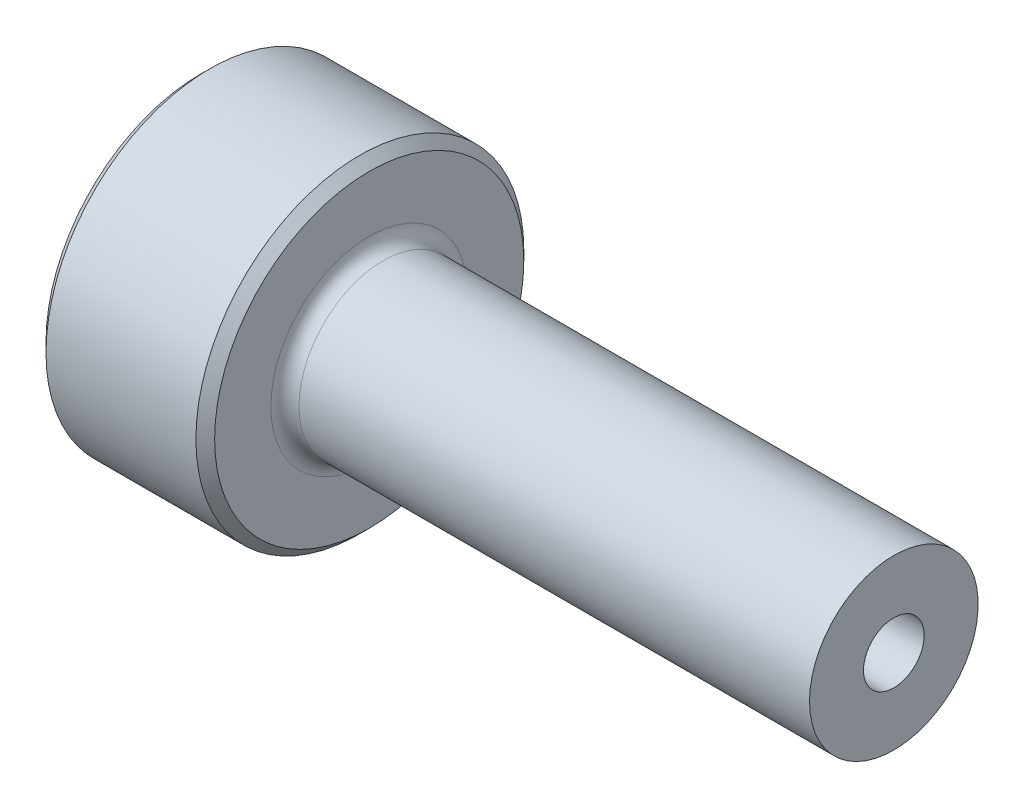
ISO-10303-21;
HEADER;
FILE_DESCRIPTION(('STEP AP214'),'2;1');
FILE_NAME('part.step','',(''),(''),'','','');
FILE_SCHEMA(('AUTOMOTIVE_DESIGN { 1 0 10303 214 1 1 1 1 }'));
ENDSEC;
DATA;
#1=APPLICATION_CONTEXT('core data for automotive mechanical design processes');
#2=APPLICATION_PROTOCOL_DEFINITION('international standard','automotive_design',2000,#1);
#3=PRODUCT_CONTEXT('',#1,'mechanical');
#4=PRODUCT('Part','Part','',(#3));
#5=PRODUCT_RELATED_PRODUCT_CATEGORY('part','',(#4));
#6=PRODUCT_DEFINITION_FORMATION('','',#4);
#7=PRODUCT_DEFINITION_CONTEXT('part definition',#1,'design');
#8=PRODUCT_DEFINITION('design','',#6,#7);
#9=PRODUCT_DEFINITION_SHAPE('','',#8);
#10=(LENGTH_UNIT() NAMED_UNIT(*) SI_UNIT(.MILLI.,.METRE.));
#11=(NAMED_UNIT(*) PLANE_ANGLE_UNIT() SI_UNIT($,.RADIAN.));
#12=(NAMED_UNIT(*) SI_UNIT($,.STERADIAN.) SOLID_ANGLE_UNIT());
#13=UNCERTAINTY_MEASURE_WITH_UNIT(LENGTH_MEASURE(1.E-05),#10,'distance_accuracy_value','');
#14=(GEOMETRIC_REPRESENTATION_CONTEXT(3) GLOBAL_UNCERTAINTY_ASSIGNED_CONTEXT((#13)) GLOBAL_UNIT_ASSIGNED_CONTEXT((#10,
#11,#12)) REPRESENTATION_CONTEXT('',''));
#15=CARTESIAN_POINT('',(0.,0.,0.));
#16=DIRECTION('',(0.,0.,1.));
#17=DIRECTION('',(1.,0.,0.));
#18=AXIS2_PLACEMENT_3D('',#15,#16,#17);
#19=CARTESIAN_POINT('',(0.,4.10062261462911,0.));
#20=DIRECTION('',(1.,0.,0.));
#21=DIRECTION('',(0.,0.,-1.));
#22=AXIS2_PLACEMENT_3D('',#19,#20,#21);
#23=PLANE('',#22);
#24=CARTESIAN_POINT('',(0.,0.,0.));
#25=DIRECTION('',(1.,0.,0.));
#26=DIRECTION('',(0.,0.,-1.));
#27=AXIS2_PLACEMENT_3D('',#24,#25,#26);
#28=CIRCLE('',#27,16.5);
#29=CARTESIAN_POINT('',(0.,0.,-16.5));
#30=VERTEX_POINT('',#29);
#31=EDGE_CURVE('E9',#30,#30,#28,.F.);
#32=ORIENTED_EDGE('',*,*,#31,.T.);
#33=EDGE_LOOP('',(#32));
#34=FACE_BOUND('',#33,.T.);
#35=CARTESIAN_POINT('',(0.,0.,0.));
#36=DIRECTION('',(-1.,0.,0.));
#37=DIRECTION('',(0.,0.,1.));
#38=AXIS2_PLACEMENT_3D('',#35,#36,#37);
#39=CIRCLE('',#38,4.10062261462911);
#40=CARTESIAN_POINT('',(0.,0.,4.10062261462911));
#41=VERTEX_POINT('',#40);
#42=EDGE_CURVE('E49',#41,#41,#39,.T.);
#43=ORIENTED_EDGE('',*,*,#42,.F.);
#44=EDGE_LOOP('',(#43));
#45=FACE_BOUND('',#44,.T.);
#46=ADVANCED_FACE('F14',(#34,#45),#23,.F.);
#47=CARTESIAN_POINT('',(0.,0.,0.));
#48=DIRECTION('',(-1.,0.,0.));
#49=DIRECTION('',(0.,0.,1.));
#50=AXIS2_PLACEMENT_3D('',#47,#48,#49);
#51=CYLINDRICAL_SURFACE('',#50,17.5);
#52=CARTESIAN_POINT('',(17.,0.,0.));
#53=DIRECTION('',(-1.,0.,0.));
#54=DIRECTION('',(0.,0.,1.));
#55=AXIS2_PLACEMENT_3D('',#52,#53,#54);
#56=CIRCLE('',#55,17.5);
#57=CARTESIAN_POINT('',(17.,0.,17.5));
#58=VERTEX_POINT('',#57);
#59=EDGE_CURVE('E25',#58,#58,#56,.T.);
#60=ORIENTED_EDGE('',*,*,#59,.T.);
#61=EDGE_LOOP('',(#60));
#62=FACE_BOUND('',#61,.T.);
#63=CARTESIAN_POINT('',(1.,0.,0.));
#64=DIRECTION('',(1.,0.,0.));
#65=DIRECTION('',(0.,0.,-1.));
#66=AXIS2_PLACEMENT_3D('',#63,#64,#65);
#67=CIRCLE('',#66,17.5);
#68=CARTESIAN_POINT('',(1.,0.,-17.5));
#69=VERTEX_POINT('',#68);
#70=EDGE_CURVE('E29',#69,#69,#67,.T.);
#71=ORIENTED_EDGE('',*,*,#70,.T.);
#72=EDGE_LOOP('',(#71));
#73=FACE_BOUND('',#72,.T.);
#74=ADVANCED_FACE('F56',(#62,#73),#51,.T.);
#75=CARTESIAN_POINT('',(18.,17.5,0.));
#76=DIRECTION('',(-1.,0.,0.));
#77=DIRECTION('',(0.,0.,1.));
#78=AXIS2_PLACEMENT_3D('',#75,#76,#77);
#79=PLANE('',#78);
#80=CARTESIAN_POINT('',(18.,0.,0.));
#81=DIRECTION('',(-1.,0.,0.));
#82=DIRECTION('',(0.,0.,1.));
#83=AXIS2_PLACEMENT_3D('',#80,#81,#82);
#84=CIRCLE('',#83,16.5);
#85=CARTESIAN_POINT('',(18.,0.,16.5));
#86=VERTEX_POINT('',#85);
#87=EDGE_CURVE('E21',#86,#86,#84,.F.);
#88=ORIENTED_EDGE('',*,*,#87,.T.);
#89=EDGE_LOOP('',(#88));
#90=FACE_BOUND('',#89,.T.);
#91=CARTESIAN_POINT('',(18.,0.,0.));
#92=DIRECTION('',(-1.,0.,0.));
#93=DIRECTION('',(0.,0.,1.));
#94=AXIS2_PLACEMENT_3D('',#91,#92,#93);
#95=CIRCLE('',#94,10.5);
#96=CARTESIAN_POINT('',(18.,0.,10.5));
#97=VERTEX_POINT('',#96);
#98=EDGE_CURVE('E34',#97,#97,#95,.T.);
#99=ORIENTED_EDGE('',*,*,#98,.T.);
#100=EDGE_LOOP('',(#99));
#101=FACE_BOUND('',#100,.T.);
#102=ADVANCED_FACE('F63',(#90,#101),#79,.F.);
#103=CARTESIAN_POINT('',(19.5,0.,0.));
#104=DIRECTION('',(-1.,0.,0.));
#105=DIRECTION('',(0.,0.,1.));
#106=AXIS2_PLACEMENT_3D('',#103,#104,#105);
#107=TOROIDAL_SURFACE('',#106,10.5,1.5);
#108=ORIENTED_EDGE('',*,*,#98,.F.);
#109=EDGE_LOOP('',(#108));
#110=FACE_BOUND('',#109,.T.);
#111=CARTESIAN_POINT('',(19.5,0.,0.));
#112=DIRECTION('',(-1.,0.,0.));
#113=DIRECTION('',(0.,0.,1.));
#114=AXIS2_PLACEMENT_3D('',#111,#112,#113);
#115=CIRCLE('',#114,9.);
#116=CARTESIAN_POINT('',(19.5,0.,9.));
#117=VERTEX_POINT('',#116);
#118=EDGE_CURVE('E37',#117,#117,#115,.T.);
#119=ORIENTED_EDGE('',*,*,#118,.T.);
#120=EDGE_LOOP('',(#119));
#121=FACE_BOUND('',#120,.T.);
#122=ADVANCED_FACE('F99',(#110,#121),#107,.F.);
#123=CARTESIAN_POINT('',(0.,0.,0.));
#124=DIRECTION('',(-1.,0.,0.));
#125=DIRECTION('',(0.,0.,1.));
#126=AXIS2_PLACEMENT_3D('',#123,#124,#125);
#127=CYLINDRICAL_SURFACE('',#126,9.);
#128=ORIENTED_EDGE('',*,*,#118,.F.);
#129=EDGE_LOOP('',(#128));
#130=FACE_BOUND('',#129,.T.);
#131=CARTESIAN_POINT('',(74.,0.,0.));
#132=DIRECTION('',(-1.,0.,0.));
#133=DIRECTION('',(0.,0.,1.));
#134=AXIS2_PLACEMENT_3D('',#131,#132,#133);
#135=CIRCLE('',#134,9.);
#136=CARTESIAN_POINT('',(74.,0.,9.));
#137=VERTEX_POINT('',#136);
#138=EDGE_CURVE('E40',#137,#137,#135,.T.);
#139=ORIENTED_EDGE('',*,*,#138,.T.);
#140=EDGE_LOOP('',(#139));
#141=FACE_BOUND('',#140,.T.);
#142=ADVANCED_FACE('F95',(#130,#141),#127,.T.);
#143=CARTESIAN_POINT('',(74.,3.23930960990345,0.));
#144=DIRECTION('',(-1.,0.,0.));
#145=DIRECTION('',(0.,0.,1.));
#146=AXIS2_PLACEMENT_3D('',#143,#144,#145);
#147=PLANE('',#146);
#148=ORIENTED_EDGE('',*,*,#138,.F.);
#149=EDGE_LOOP('',(#148));
#150=FACE_BOUND('',#149,.T.);
#151=CARTESIAN_POINT('',(74.,0.,0.));
#152=DIRECTION('',(-1.,0.,0.));
#153=DIRECTION('',(0.,0.,1.));
#154=AXIS2_PLACEMENT_3D('',#151,#152,#153);
#155=CIRCLE('',#154,3.23930960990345);
#156=CARTESIAN_POINT('',(74.,0.,3.23930960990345));
#157=VERTEX_POINT('',#156);
#158=EDGE_CURVE('E43',#157,#157,#155,.T.);
#159=ORIENTED_EDGE('',*,*,#158,.T.);
#160=EDGE_LOOP('',(#159));
#161=FACE_BOUND('',#160,.T.);
#162=ADVANCED_FACE('F88',(#150,#161),#147,.F.);
#163=CARTESIAN_POINT('',(3.,0.,0.));
#164=DIRECTION('',(1.,0.,0.));
#165=DIRECTION('',(0.,0.,-1.));
#166=AXIS2_PLACEMENT_3D('',#163,#164,#165);
#167=CONICAL_SURFACE('',#166,2.,0.0174532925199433);
#168=ORIENTED_EDGE('',*,*,#158,.F.);
#169=EDGE_LOOP('',(#168));
#170=FACE_BOUND('',#169,.T.);
#171=CARTESIAN_POINT('',(3.,0.,0.));
#172=DIRECTION('',(-1.,0.,0.));
#173=DIRECTION('',(0.,0.,1.));
#174=AXIS2_PLACEMENT_3D('',#171,#172,#173);
#175=CIRCLE('',#174,2.);
#176=CARTESIAN_POINT('',(3.,0.,2.));
#177=VERTEX_POINT('',#176);
#178=EDGE_CURVE('E46',#177,#177,#175,.T.);
#179=ORIENTED_EDGE('',*,*,#178,.T.);
#180=EDGE_LOOP('',(#179));
#181=FACE_BOUND('',#180,.T.);
#182=ADVANCED_FACE('F76',(#170,#181),#167,.F.);
#183=CARTESIAN_POINT('',(0.,0.,0.));
#184=DIRECTION('',(-1.,0.,0.));
#185=DIRECTION('',(0.,0.,1.));
#186=AXIS2_PLACEMENT_3D('',#183,#184,#185);
#187=CONICAL_SURFACE('',#186,4.10062261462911,0.61086523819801);
#188=ORIENTED_EDGE('',*,*,#178,.F.);
#189=EDGE_LOOP('',(#188));
#190=FACE_BOUND('',#189,.T.);
#191=ORIENTED_EDGE('',*,*,#42,.T.);
#192=EDGE_LOOP('',(#191));
#193=FACE_BOUND('',#192,.T.);
#194=ADVANCED_FACE('F53',(#190,#193),#187,.F.);
#195=CARTESIAN_POINT('',(17.,0.,0.));
#196=DIRECTION('',(-1.,0.,0.));
#197=DIRECTION('',(0.,0.,1.));
#198=AXIS2_PLACEMENT_3D('',#195,#196,#197);
#199=CONICAL_SURFACE('',#198,17.5,0.785398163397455);
#200=ORIENTED_EDGE('',*,*,#87,.F.);
#201=EDGE_LOOP('',(#200));
#202=FACE_BOUND('',#201,.T.);
#203=ORIENTED_EDGE('',*,*,#59,.F.);
#204=EDGE_LOOP('',(#203));
#205=FACE_BOUND('',#204,.T.);
#206=ADVANCED_FACE('F67',(#202,#205),#199,.T.);
#207=CARTESIAN_POINT('',(0.,0.,0.));
#208=DIRECTION('',(1.,0.,0.));
#209=DIRECTION('',(0.,0.,-1.));
#210=AXIS2_PLACEMENT_3D('',#207,#208,#209);
#211=CONICAL_SURFACE('',#210,16.5,0.785398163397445);
#212=ORIENTED_EDGE('',*,*,#70,.F.);
#213=EDGE_LOOP('',(#212));
#214=FACE_BOUND('',#213,.T.);
#215=ORIENTED_EDGE('',*,*,#31,.F.);
#216=EDGE_LOOP('',(#215));
#217=FACE_BOUND('',#216,.T.);
#218=ADVANCED_FACE('F16',(#214,#217),#211,.T.);
#219=CLOSED_SHELL('',(#46,#74,#102,#122,#142,#162,#182,#194,#206,#218));
#220=MANIFOLD_SOLID_BREP('B1',#219);
#221=ADVANCED_BREP_SHAPE_REPRESENTATION('',(#18,#220),#14);
#222=SHAPE_DEFINITION_REPRESENTATION(#9,#221);
ENDSEC;
END-ISO-10303-21;
